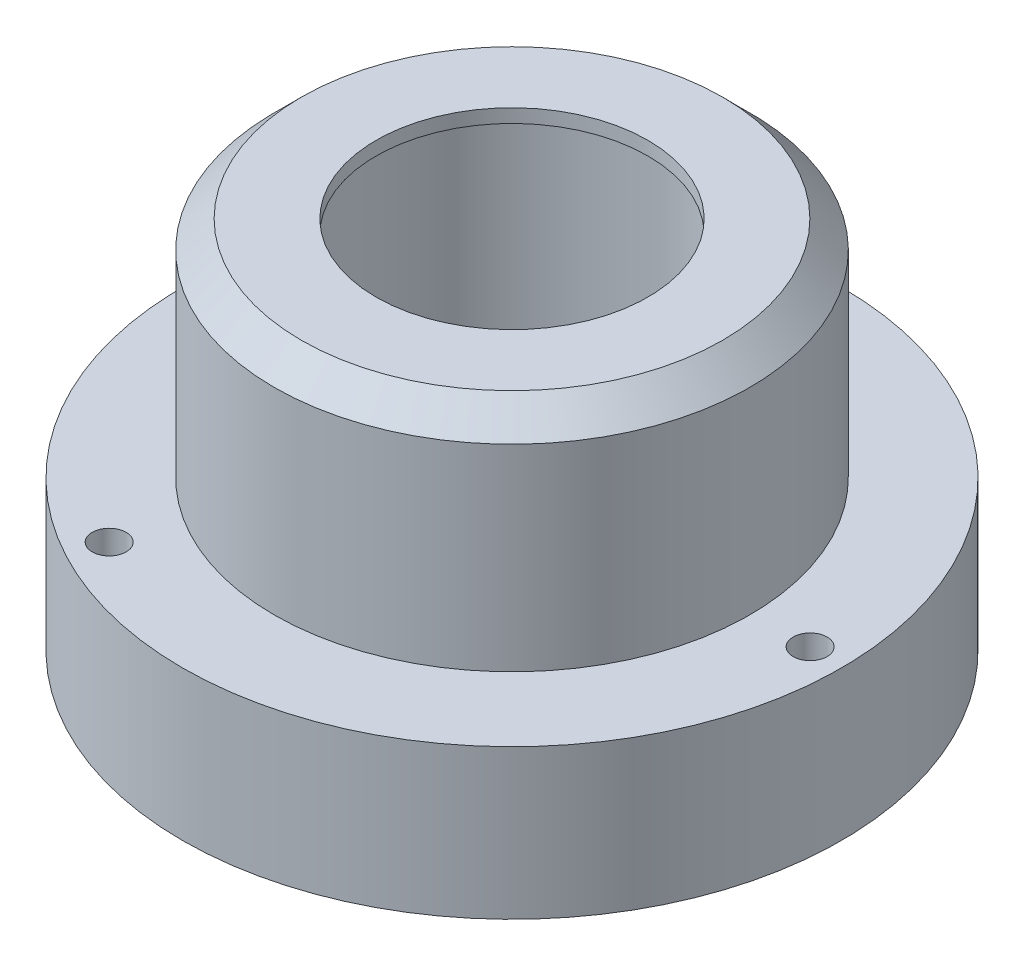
ISO-10303-21;
HEADER;
FILE_DESCRIPTION(('STEP AP214'),'2;1');
FILE_NAME('part.step','',(''),(''),'','','');
FILE_SCHEMA(('AUTOMOTIVE_DESIGN { 1 0 10303 214 1 1 1 1 }'));
ENDSEC;
DATA;
#1=APPLICATION_CONTEXT('core data for automotive mechanical design processes');
#2=APPLICATION_PROTOCOL_DEFINITION('international standard','automotive_design',2000,#1);
#3=PRODUCT_CONTEXT('',#1,'mechanical');
#4=PRODUCT('Part','Part','',(#3));
#5=PRODUCT_RELATED_PRODUCT_CATEGORY('part','',(#4));
#6=PRODUCT_DEFINITION_FORMATION('','',#4);
#7=PRODUCT_DEFINITION_CONTEXT('part definition',#1,'design');
#8=PRODUCT_DEFINITION('design','',#6,#7);
#9=PRODUCT_DEFINITION_SHAPE('','',#8);
#10=(LENGTH_UNIT() NAMED_UNIT(*) SI_UNIT(.MILLI.,.METRE.));
#11=(NAMED_UNIT(*) PLANE_ANGLE_UNIT() SI_UNIT($,.RADIAN.));
#12=(NAMED_UNIT(*) SI_UNIT($,.STERADIAN.) SOLID_ANGLE_UNIT());
#13=UNCERTAINTY_MEASURE_WITH_UNIT(LENGTH_MEASURE(1.E-05),#10,'distance_accuracy_value','');
#14=(GEOMETRIC_REPRESENTATION_CONTEXT(3) GLOBAL_UNCERTAINTY_ASSIGNED_CONTEXT((#13)) GLOBAL_UNIT_ASSIGNED_CONTEXT((#10,
#11,#12)) REPRESENTATION_CONTEXT('',''));
#15=CARTESIAN_POINT('',(0.,0.,0.));
#16=DIRECTION('',(0.,0.,1.));
#17=DIRECTION('',(1.,0.,0.));
#18=AXIS2_PLACEMENT_3D('',#15,#16,#17);
#19=CARTESIAN_POINT('',(48.5,0.,0.));
#20=DIRECTION('',(0.,1.,0.));
#21=DIRECTION('',(0.,0.,1.));
#22=AXIS2_PLACEMENT_3D('',#19,#20,#21);
#23=PLANE('',#22);
#24=CARTESIAN_POINT('',(21.4999999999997,0.,37.2390923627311));
#25=DIRECTION('',(0.,-1.,0.));
#26=DIRECTION('',(0.,0.,-1.));
#27=AXIS2_PLACEMENT_3D('',#24,#25,#26);
#28=CIRCLE('',#27,2.5);
#29=CARTESIAN_POINT('',(21.4999999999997,0.,34.7390923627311));
#30=VERTEX_POINT('',#29);
#31=EDGE_CURVE('E79',#30,#30,#28,.T.);
#32=ORIENTED_EDGE('',*,*,#31,.F.);
#33=EDGE_LOOP('',(#32));
#34=FACE_BOUND('',#33,.T.);
#35=CARTESIAN_POINT('',(21.5000000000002,0.,-37.2390923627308));
#36=DIRECTION('',(0.,-1.,0.));
#37=DIRECTION('',(0.,0.,-1.));
#38=AXIS2_PLACEMENT_3D('',#35,#36,#37);
#39=CIRCLE('',#38,2.5);
#40=CARTESIAN_POINT('',(21.5000000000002,0.,-39.7390923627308));
#41=VERTEX_POINT('',#40);
#42=EDGE_CURVE('E87',#41,#41,#39,.T.);
#43=ORIENTED_EDGE('',*,*,#42,.F.);
#44=EDGE_LOOP('',(#43));
#45=FACE_BOUND('',#44,.T.);
#46=CARTESIAN_POINT('',(-13.9999999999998,0.,-24.2487113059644));
#47=DIRECTION('',(0.,-1.,0.));
#48=DIRECTION('',(0.,0.,-1.));
#49=AXIS2_PLACEMENT_3D('',#46,#47,#48);
#50=CIRCLE('',#49,1.65);
#51=CARTESIAN_POINT('',(-13.9999999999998,0.,-25.8987113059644));
#52=VERTEX_POINT('',#51);
#53=EDGE_CURVE('E93',#52,#52,#50,.T.);
#54=ORIENTED_EDGE('',*,*,#53,.F.);
#55=EDGE_LOOP('',(#54));
#56=FACE_BOUND('',#55,.T.);
#57=CARTESIAN_POINT('',(-14.0000000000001,0.,24.2487113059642));
#58=DIRECTION('',(0.,-1.,0.));
#59=DIRECTION('',(0.,0.,-1.));
#60=AXIS2_PLACEMENT_3D('',#57,#58,#59);
#61=CIRCLE('',#60,1.65);
#62=CARTESIAN_POINT('',(-14.0000000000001,0.,22.5987113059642));
#63=VERTEX_POINT('',#62);
#64=EDGE_CURVE('E99',#63,#63,#61,.T.);
#65=ORIENTED_EDGE('',*,*,#64,.F.);
#66=EDGE_LOOP('',(#65));
#67=FACE_BOUND('',#66,.T.);
#68=CARTESIAN_POINT('',(-43.,0.,0.));
#69=DIRECTION('',(0.,-1.,0.));
#70=DIRECTION('',(0.,0.,-1.));
#71=AXIS2_PLACEMENT_3D('',#68,#69,#70);
#72=CIRCLE('',#71,2.5);
#73=CARTESIAN_POINT('',(-43.,0.,-2.5));
#74=VERTEX_POINT('',#73);
#75=EDGE_CURVE('E117',#74,#74,#72,.T.);
#76=ORIENTED_EDGE('',*,*,#75,.F.);
#77=EDGE_LOOP('',(#76));
#78=FACE_BOUND('',#77,.T.);
#79=CARTESIAN_POINT('',(28.,0.,0.));
#80=DIRECTION('',(0.,-1.,0.));
#81=DIRECTION('',(0.,0.,-1.));
#82=AXIS2_PLACEMENT_3D('',#79,#80,#81);
#83=CIRCLE('',#82,1.65);
#84=CARTESIAN_POINT('',(28.,0.,-1.65));
#85=VERTEX_POINT('',#84);
#86=EDGE_CURVE('E123',#85,#85,#83,.T.);
#87=ORIENTED_EDGE('',*,*,#86,.F.);
#88=EDGE_LOOP('',(#87));
#89=FACE_BOUND('',#88,.T.);
#90=CARTESIAN_POINT('',(0.,0.,0.));
#91=DIRECTION('',(0.,1.,0.));
#92=DIRECTION('',(0.,0.,1.));
#93=AXIS2_PLACEMENT_3D('',#90,#91,#92);
#94=CIRCLE('',#93,48.5);
#95=CARTESIAN_POINT('',(0.,0.,48.5));
#96=VERTEX_POINT('',#95);
#97=EDGE_CURVE('E132',#96,#96,#94,.T.);
#98=ORIENTED_EDGE('',*,*,#97,.F.);
#99=EDGE_LOOP('',(#98));
#100=FACE_BOUND('',#99,.T.);
#101=CARTESIAN_POINT('',(0.,0.,0.));
#102=DIRECTION('',(0.,1.,0.));
#103=DIRECTION('',(0.,0.,1.));
#104=AXIS2_PLACEMENT_3D('',#101,#102,#103);
#105=CIRCLE('',#104,23.5);
#106=CARTESIAN_POINT('',(0.,0.,23.5));
#107=VERTEX_POINT('',#106);
#108=EDGE_CURVE('E11',#107,#107,#105,.T.);
#109=ORIENTED_EDGE('',*,*,#108,.T.);
#110=EDGE_LOOP('',(#109));
#111=FACE_BOUND('',#110,.T.);
#112=ADVANCED_FACE('F35',(#34,#45,#56,#67,#78,#89,#100,#111),#23,.F.);
#113=CARTESIAN_POINT('',(0.,45.2474448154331,0.));
#114=DIRECTION('',(0.,1.,0.));
#115=DIRECTION('',(0.,0.,1.));
#116=AXIS2_PLACEMENT_3D('',#113,#114,#115);
#117=CYLINDRICAL_SURFACE('',#116,23.5);
#118=ORIENTED_EDGE('',*,*,#108,.F.);
#119=EDGE_LOOP('',(#118));
#120=FACE_BOUND('',#119,.T.);
#121=CARTESIAN_POINT('',(0.,53.,0.));
#122=DIRECTION('',(0.,1.,0.));
#123=DIRECTION('',(0.,0.,1.));
#124=AXIS2_PLACEMENT_3D('',#121,#122,#123);
#125=CIRCLE('',#124,23.5);
#126=CARTESIAN_POINT('',(0.,53.,23.5));
#127=VERTEX_POINT('',#126);
#128=EDGE_CURVE('E42',#127,#127,#125,.T.);
#129=ORIENTED_EDGE('',*,*,#128,.T.);
#130=EDGE_LOOP('',(#129));
#131=FACE_BOUND('',#130,.T.);
#132=ADVANCED_FACE('F155',(#120,#131),#117,.F.);
#133=CARTESIAN_POINT('',(23.5,53.,0.));
#134=DIRECTION('',(0.,1.,0.));
#135=DIRECTION('',(0.,0.,1.));
#136=AXIS2_PLACEMENT_3D('',#133,#134,#135);
#137=PLANE('',#136);
#138=ORIENTED_EDGE('',*,*,#128,.F.);
#139=EDGE_LOOP('',(#138));
#140=FACE_BOUND('',#139,.T.);
#141=CARTESIAN_POINT('',(0.,53.,0.));
#142=DIRECTION('',(0.,1.,0.));
#143=DIRECTION('',(0.,0.,1.));
#144=AXIS2_PLACEMENT_3D('',#141,#142,#143);
#145=CIRCLE('',#144,20.);
#146=CARTESIAN_POINT('',(0.,53.,20.));
#147=VERTEX_POINT('',#146);
#148=EDGE_CURVE('E150',#147,#147,#145,.T.);
#149=ORIENTED_EDGE('',*,*,#148,.T.);
#150=EDGE_LOOP('',(#149));
#151=FACE_BOUND('',#150,.T.);
#152=ADVANCED_FACE('F157',(#140,#151),#137,.F.);
#153=CARTESIAN_POINT('',(0.,45.2474448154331,0.));
#154=DIRECTION('',(0.,1.,0.));
#155=DIRECTION('',(0.,0.,1.));
#156=AXIS2_PLACEMENT_3D('',#153,#154,#155);
#157=CYLINDRICAL_SURFACE('',#156,20.);
#158=ORIENTED_EDGE('',*,*,#148,.F.);
#159=EDGE_LOOP('',(#158));
#160=FACE_BOUND('',#159,.T.);
#161=CARTESIAN_POINT('',(0.,55.,0.));
#162=DIRECTION('',(0.,1.,0.));
#163=DIRECTION('',(0.,0.,1.));
#164=AXIS2_PLACEMENT_3D('',#161,#162,#163);
#165=CIRCLE('',#164,20.);
#166=CARTESIAN_POINT('',(0.,55.,20.));
#167=VERTEX_POINT('',#166);
#168=EDGE_CURVE('E147',#167,#167,#165,.T.);
#169=ORIENTED_EDGE('',*,*,#168,.T.);
#170=EDGE_LOOP('',(#169));
#171=FACE_BOUND('',#170,.T.);
#172=ADVANCED_FACE('F160',(#160,#171),#157,.F.);
#173=CARTESIAN_POINT('',(20.,55.,0.));
#174=DIRECTION('',(0.,-1.,0.));
#175=DIRECTION('',(0.,0.,-1.));
#176=AXIS2_PLACEMENT_3D('',#173,#174,#175);
#177=PLANE('',#176);
#178=ORIENTED_EDGE('',*,*,#168,.F.);
#179=EDGE_LOOP('',(#178));
#180=FACE_BOUND('',#179,.T.);
#181=CARTESIAN_POINT('',(0.,55.,0.));
#182=DIRECTION('',(0.,1.,0.));
#183=DIRECTION('',(0.,0.,1.));
#184=AXIS2_PLACEMENT_3D('',#181,#182,#183);
#185=CIRCLE('',#184,31.);
#186=CARTESIAN_POINT('',(0.,55.,31.));
#187=VERTEX_POINT('',#186);
#188=EDGE_CURVE('E144',#187,#187,#185,.T.);
#189=ORIENTED_EDGE('',*,*,#188,.T.);
#190=EDGE_LOOP('',(#189));
#191=FACE_BOUND('',#190,.T.);
#192=ADVANCED_FACE('F166',(#180,#191),#177,.F.);
#193=CARTESIAN_POINT('',(0.,51.,0.));
#194=DIRECTION('',(0.,-1.,0.));
#195=DIRECTION('',(0.,0.,-1.));
#196=AXIS2_PLACEMENT_3D('',#193,#194,#195);
#197=CONICAL_SURFACE('',#196,35.,0.785398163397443);
#198=ORIENTED_EDGE('',*,*,#188,.F.);
#199=EDGE_LOOP('',(#198));
#200=FACE_BOUND('',#199,.T.);
#201=CARTESIAN_POINT('',(0.,51.,0.));
#202=DIRECTION('',(0.,1.,0.));
#203=DIRECTION('',(0.,0.,1.));
#204=AXIS2_PLACEMENT_3D('',#201,#202,#203);
#205=CIRCLE('',#204,35.);
#206=CARTESIAN_POINT('',(0.,51.,35.));
#207=VERTEX_POINT('',#206);
#208=EDGE_CURVE('E141',#207,#207,#205,.T.);
#209=ORIENTED_EDGE('',*,*,#208,.T.);
#210=EDGE_LOOP('',(#209));
#211=FACE_BOUND('',#210,.T.);
#212=ADVANCED_FACE('F172',(#200,#211),#197,.T.);
#213=CARTESIAN_POINT('',(0.,45.2474448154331,0.));
#214=DIRECTION('',(0.,1.,0.));
#215=DIRECTION('',(0.,0.,1.));
#216=AXIS2_PLACEMENT_3D('',#213,#214,#215);
#217=CYLINDRICAL_SURFACE('',#216,35.);
#218=ORIENTED_EDGE('',*,*,#208,.F.);
#219=EDGE_LOOP('',(#218));
#220=FACE_BOUND('',#219,.T.);
#221=CARTESIAN_POINT('',(0.,22.,0.));
#222=DIRECTION('',(0.,1.,0.));
#223=DIRECTION('',(0.,0.,1.));
#224=AXIS2_PLACEMENT_3D('',#221,#222,#223);
#225=CIRCLE('',#224,35.);
#226=CARTESIAN_POINT('',(0.,22.,35.));
#227=VERTEX_POINT('',#226);
#228=EDGE_CURVE('E138',#227,#227,#225,.T.);
#229=ORIENTED_EDGE('',*,*,#228,.T.);
#230=EDGE_LOOP('',(#229));
#231=FACE_BOUND('',#230,.T.);
#232=ADVANCED_FACE('F178',(#220,#231),#217,.T.);
#233=CARTESIAN_POINT('',(35.,22.,0.));
#234=DIRECTION('',(0.,-1.,0.));
#235=DIRECTION('',(0.,0.,-1.));
#236=AXIS2_PLACEMENT_3D('',#233,#234,#235);
#237=PLANE('',#236);
#238=CARTESIAN_POINT('',(-22.0764460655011,22.,-37.4817359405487));
#239=DIRECTION('',(0.,1.,0.));
#240=DIRECTION('',(0.,0.,1.));
#241=AXIS2_PLACEMENT_3D('',#238,#239,#240);
#242=CIRCLE('',#241,2.5);
#243=CARTESIAN_POINT('',(-22.0764460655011,22.,-34.9817359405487));
#244=VERTEX_POINT('',#243);
#245=EDGE_CURVE('E105',#244,#244,#242,.T.);
#246=ORIENTED_EDGE('',*,*,#245,.F.);
#247=EDGE_LOOP('',(#246));
#248=FACE_BOUND('',#247,.T.);
#249=CARTESIAN_POINT('',(-21.4219124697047,22.,37.8596310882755));
#250=DIRECTION('',(0.,1.,0.));
#251=DIRECTION('',(0.,0.,1.));
#252=AXIS2_PLACEMENT_3D('',#249,#250,#251);
#253=CIRCLE('',#252,2.5);
#254=CARTESIAN_POINT('',(-21.4219124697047,22.,40.3596310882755));
#255=VERTEX_POINT('',#254);
#256=EDGE_CURVE('E111',#255,#255,#253,.T.);
#257=ORIENTED_EDGE('',*,*,#256,.F.);
#258=EDGE_LOOP('',(#257));
#259=FACE_BOUND('',#258,.T.);
#260=CARTESIAN_POINT('',(43.498358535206,22.,-0.37789514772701));
#261=DIRECTION('',(0.,1.,0.));
#262=DIRECTION('',(0.,0.,1.));
#263=AXIS2_PLACEMENT_3D('',#260,#261,#262);
#264=CIRCLE('',#263,2.5);
#265=CARTESIAN_POINT('',(43.498358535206,22.,2.12210485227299));
#266=VERTEX_POINT('',#265);
#267=EDGE_CURVE('E129',#266,#266,#264,.T.);
#268=ORIENTED_EDGE('',*,*,#267,.F.);
#269=EDGE_LOOP('',(#268));
#270=FACE_BOUND('',#269,.T.);
#271=ORIENTED_EDGE('',*,*,#228,.F.);
#272=EDGE_LOOP('',(#271));
#273=FACE_BOUND('',#272,.T.);
#274=CARTESIAN_POINT('',(0.,22.,0.));
#275=DIRECTION('',(0.,1.,0.));
#276=DIRECTION('',(0.,0.,1.));
#277=AXIS2_PLACEMENT_3D('',#274,#275,#276);
#278=CIRCLE('',#277,48.5);
#279=CARTESIAN_POINT('',(0.,22.,48.5));
#280=VERTEX_POINT('',#279);
#281=EDGE_CURVE('E135',#280,#280,#278,.T.);
#282=ORIENTED_EDGE('',*,*,#281,.T.);
#283=EDGE_LOOP('',(#282));
#284=FACE_BOUND('',#283,.T.);
#285=ADVANCED_FACE('F184',(#248,#259,#270,#273,#284),#237,.F.);
#286=CARTESIAN_POINT('',(0.,45.2474448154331,0.));
#287=DIRECTION('',(0.,1.,0.));
#288=DIRECTION('',(0.,0.,1.));
#289=AXIS2_PLACEMENT_3D('',#286,#287,#288);
#290=CYLINDRICAL_SURFACE('',#289,48.5);
#291=ORIENTED_EDGE('',*,*,#281,.F.);
#292=EDGE_LOOP('',(#291));
#293=FACE_BOUND('',#292,.T.);
#294=ORIENTED_EDGE('',*,*,#97,.T.);
#295=EDGE_LOOP('',(#294));
#296=FACE_BOUND('',#295,.T.);
#297=ADVANCED_FACE('F190',(#293,#296),#290,.T.);
#298=CARTESIAN_POINT('',(43.498358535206,22.,-0.37789514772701));
#299=DIRECTION('',(0.,1.,0.));
#300=DIRECTION('',(0.,0.,1.));
#301=AXIS2_PLACEMENT_3D('',#298,#299,#300);
#302=CYLINDRICAL_SURFACE('',#301,2.5);
#303=CARTESIAN_POINT('',(43.498358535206,5.,-0.37789514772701));
#304=DIRECTION('',(0.,1.,0.));
#305=DIRECTION('',(0.,0.,1.));
#306=AXIS2_PLACEMENT_3D('',#303,#304,#305);
#307=CIRCLE('',#306,2.5);
#308=CARTESIAN_POINT('',(43.498358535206,5.,2.12210485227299));
#309=VERTEX_POINT('',#308);
#310=EDGE_CURVE('E126',#309,#309,#307,.T.);
#311=ORIENTED_EDGE('',*,*,#310,.F.);
#312=EDGE_LOOP('',(#311));
#313=FACE_BOUND('',#312,.T.);
#314=ORIENTED_EDGE('',*,*,#267,.T.);
#315=EDGE_LOOP('',(#314));
#316=FACE_BOUND('',#315,.T.);
#317=ADVANCED_FACE('F197',(#313,#316),#302,.F.);
#318=CARTESIAN_POINT('',(43.498358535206,5.,-0.37789514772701));
#319=DIRECTION('',(0.,1.,0.));
#320=DIRECTION('',(0.,0.,1.));
#321=AXIS2_PLACEMENT_3D('',#318,#319,#320);
#322=CONICAL_SURFACE('',#321,2.5,1.04719755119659);
#323=CARTESIAN_POINT('',(43.498358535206,3.55662432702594,-0.37789514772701));
#324=VERTEX_POINT('',#323);
#325=VERTEX_LOOP('',#324);
#326=FACE_BOUND('',#325,.T.);
#327=ORIENTED_EDGE('',*,*,#310,.T.);
#328=EDGE_LOOP('',(#327));
#329=FACE_BOUND('',#328,.T.);
#330=ADVANCED_FACE('F212',(#326,#329),#322,.F.);
#331=CARTESIAN_POINT('',(28.,0.,0.));
#332=DIRECTION('',(0.,-1.,0.));
#333=DIRECTION('',(0.,0.,-1.));
#334=AXIS2_PLACEMENT_3D('',#331,#332,#333);
#335=CYLINDRICAL_SURFACE('',#334,1.65);
#336=CARTESIAN_POINT('',(28.,11.5,0.));
#337=DIRECTION('',(0.,-1.,0.));
#338=DIRECTION('',(0.,0.,-1.));
#339=AXIS2_PLACEMENT_3D('',#336,#337,#338);
#340=CIRCLE('',#339,1.65);
#341=CARTESIAN_POINT('',(28.,11.5,-1.64999999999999));
#342=VERTEX_POINT('',#341);
#343=EDGE_CURVE('E120',#342,#342,#340,.T.);
#344=ORIENTED_EDGE('',*,*,#343,.F.);
#345=EDGE_LOOP('',(#344));
#346=FACE_BOUND('',#345,.T.);
#347=ORIENTED_EDGE('',*,*,#86,.T.);
#348=EDGE_LOOP('',(#347));
#349=FACE_BOUND('',#348,.T.);
#350=ADVANCED_FACE('F216',(#346,#349),#335,.F.);
#351=CARTESIAN_POINT('',(28.,11.5,0.));
#352=DIRECTION('',(0.,-1.,0.));
#353=DIRECTION('',(0.,0.,-1.));
#354=AXIS2_PLACEMENT_3D('',#351,#352,#353);
#355=CONICAL_SURFACE('',#354,1.65,1.04719755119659);
#356=CARTESIAN_POINT('',(28.,12.4526279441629,0.));
#357=VERTEX_POINT('',#356);
#358=VERTEX_LOOP('',#357);
#359=FACE_BOUND('',#358,.T.);
#360=ORIENTED_EDGE('',*,*,#343,.T.);
#361=EDGE_LOOP('',(#360));
#362=FACE_BOUND('',#361,.T.);
#363=ADVANCED_FACE('F219',(#359,#362),#355,.F.);
#364=CARTESIAN_POINT('',(-43.,0.,0.));
#365=DIRECTION('',(0.,-1.,0.));
#366=DIRECTION('',(0.,0.,-1.));
#367=AXIS2_PLACEMENT_3D('',#364,#365,#366);
#368=CYLINDRICAL_SURFACE('',#367,2.5);
#369=CARTESIAN_POINT('',(-43.,17.,0.));
#370=DIRECTION('',(0.,-1.,0.));
#371=DIRECTION('',(0.,0.,-1.));
#372=AXIS2_PLACEMENT_3D('',#369,#370,#371);
#373=CIRCLE('',#372,2.5);
#374=CARTESIAN_POINT('',(-43.,17.,-2.49999999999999));
#375=VERTEX_POINT('',#374);
#376=EDGE_CURVE('E114',#375,#375,#373,.T.);
#377=ORIENTED_EDGE('',*,*,#376,.F.);
#378=EDGE_LOOP('',(#377));
#379=FACE_BOUND('',#378,.T.);
#380=ORIENTED_EDGE('',*,*,#75,.T.);
#381=EDGE_LOOP('',(#380));
#382=FACE_BOUND('',#381,.T.);
#383=ADVANCED_FACE('F223',(#379,#382),#368,.F.);
#384=CARTESIAN_POINT('',(-43.,17.,0.));
#385=DIRECTION('',(0.,-1.,0.));
#386=DIRECTION('',(0.,0.,-1.));
#387=AXIS2_PLACEMENT_3D('',#384,#385,#386);
#388=CONICAL_SURFACE('',#387,2.5,1.0471975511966);
#389=CARTESIAN_POINT('',(-43.,18.4433756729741,0.));
#390=VERTEX_POINT('',#389);
#391=VERTEX_LOOP('',#390);
#392=FACE_BOUND('',#391,.T.);
#393=ORIENTED_EDGE('',*,*,#376,.T.);
#394=EDGE_LOOP('',(#393));
#395=FACE_BOUND('',#394,.T.);
#396=ADVANCED_FACE('F226',(#392,#395),#388,.F.);
#397=CARTESIAN_POINT('',(-21.4219124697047,22.,37.8596310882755));
#398=DIRECTION('',(0.,1.,0.));
#399=DIRECTION('',(0.,0.,1.));
#400=AXIS2_PLACEMENT_3D('',#397,#398,#399);
#401=CYLINDRICAL_SURFACE('',#400,2.5);
#402=CARTESIAN_POINT('',(-21.4219124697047,5.,37.8596310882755));
#403=DIRECTION('',(0.,1.,0.));
#404=DIRECTION('',(0.,0.,1.));
#405=AXIS2_PLACEMENT_3D('',#402,#403,#404);
#406=CIRCLE('',#405,2.5);
#407=CARTESIAN_POINT('',(-21.4219124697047,5.,40.3596310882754));
#408=VERTEX_POINT('',#407);
#409=EDGE_CURVE('E108',#408,#408,#406,.T.);
#410=ORIENTED_EDGE('',*,*,#409,.F.);
#411=EDGE_LOOP('',(#410));
#412=FACE_BOUND('',#411,.T.);
#413=ORIENTED_EDGE('',*,*,#256,.T.);
#414=EDGE_LOOP('',(#413));
#415=FACE_BOUND('',#414,.T.);
#416=ADVANCED_FACE('F230',(#412,#415),#401,.F.);
#417=CARTESIAN_POINT('',(-21.4219124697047,5.,37.8596310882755));
#418=DIRECTION('',(0.,1.,0.));
#419=DIRECTION('',(0.,0.,1.));
#420=AXIS2_PLACEMENT_3D('',#417,#418,#419);
#421=CONICAL_SURFACE('',#420,2.5,1.04719755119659);
#422=CARTESIAN_POINT('',(-21.4219124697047,3.55662432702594,37.8596310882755));
#423=VERTEX_POINT('',#422);
#424=VERTEX_LOOP('',#423);
#425=FACE_BOUND('',#424,.T.);
#426=ORIENTED_EDGE('',*,*,#409,.T.);
#427=EDGE_LOOP('',(#426));
#428=FACE_BOUND('',#427,.T.);
#429=ADVANCED_FACE('F234',(#425,#428),#421,.F.);
#430=CARTESIAN_POINT('',(-22.0764460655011,22.,-37.4817359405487));
#431=DIRECTION('',(0.,1.,0.));
#432=DIRECTION('',(0.,0.,1.));
#433=AXIS2_PLACEMENT_3D('',#430,#431,#432);
#434=CYLINDRICAL_SURFACE('',#433,2.5);
#435=CARTESIAN_POINT('',(-22.0764460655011,5.,-37.4817359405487));
#436=DIRECTION('',(0.,1.,0.));
#437=DIRECTION('',(0.,0.,1.));
#438=AXIS2_PLACEMENT_3D('',#435,#436,#437);
#439=CIRCLE('',#438,2.5);
#440=CARTESIAN_POINT('',(-22.0764460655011,5.,-34.9817359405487));
#441=VERTEX_POINT('',#440);
#442=EDGE_CURVE('E102',#441,#441,#439,.T.);
#443=ORIENTED_EDGE('',*,*,#442,.F.);
#444=EDGE_LOOP('',(#443));
#445=FACE_BOUND('',#444,.T.);
#446=ORIENTED_EDGE('',*,*,#245,.T.);
#447=EDGE_LOOP('',(#446));
#448=FACE_BOUND('',#447,.T.);
#449=ADVANCED_FACE('F238',(#445,#448),#434,.F.);
#450=CARTESIAN_POINT('',(-22.0764460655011,5.,-37.4817359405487));
#451=DIRECTION('',(0.,1.,0.));
#452=DIRECTION('',(0.,0.,1.));
#453=AXIS2_PLACEMENT_3D('',#450,#451,#452);
#454=CONICAL_SURFACE('',#453,2.5,1.04719755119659);
#455=CARTESIAN_POINT('',(-22.0764460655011,3.55662432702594,-37.4817359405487));
#456=VERTEX_POINT('',#455);
#457=VERTEX_LOOP('',#456);
#458=FACE_BOUND('',#457,.T.);
#459=ORIENTED_EDGE('',*,*,#442,.T.);
#460=EDGE_LOOP('',(#459));
#461=FACE_BOUND('',#460,.T.);
#462=ADVANCED_FACE('F242',(#458,#461),#454,.F.);
#463=CARTESIAN_POINT('',(-14.0000000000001,0.,24.2487113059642));
#464=DIRECTION('',(0.,-1.,0.));
#465=DIRECTION('',(0.,0.,-1.));
#466=AXIS2_PLACEMENT_3D('',#463,#464,#465);
#467=CYLINDRICAL_SURFACE('',#466,1.65);
#468=CARTESIAN_POINT('',(-14.0000000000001,11.5,24.2487113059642));
#469=DIRECTION('',(0.,-1.,0.));
#470=DIRECTION('',(0.,0.,-1.));
#471=AXIS2_PLACEMENT_3D('',#468,#469,#470);
#472=CIRCLE('',#471,1.65);
#473=CARTESIAN_POINT('',(-14.0000000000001,11.5,22.5987113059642));
#474=VERTEX_POINT('',#473);
#475=EDGE_CURVE('E96',#474,#474,#472,.T.);
#476=ORIENTED_EDGE('',*,*,#475,.F.);
#477=EDGE_LOOP('',(#476));
#478=FACE_BOUND('',#477,.T.);
#479=ORIENTED_EDGE('',*,*,#64,.T.);
#480=EDGE_LOOP('',(#479));
#481=FACE_BOUND('',#480,.T.);
#482=ADVANCED_FACE('F246',(#478,#481),#467,.F.);
#483=CARTESIAN_POINT('',(-14.0000000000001,11.5,24.2487113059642));
#484=DIRECTION('',(0.,-1.,0.));
#485=DIRECTION('',(0.,0.,-1.));
#486=AXIS2_PLACEMENT_3D('',#483,#484,#485);
#487=CONICAL_SURFACE('',#486,1.65,1.0471975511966);
#488=CARTESIAN_POINT('',(-14.0000000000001,12.4526279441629,24.2487113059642));
#489=VERTEX_POINT('',#488);
#490=VERTEX_LOOP('',#489);
#491=FACE_BOUND('',#490,.T.);
#492=ORIENTED_EDGE('',*,*,#475,.T.);
#493=EDGE_LOOP('',(#492));
#494=FACE_BOUND('',#493,.T.);
#495=ADVANCED_FACE('F250',(#491,#494),#487,.F.);
#496=CARTESIAN_POINT('',(-13.9999999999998,0.,-24.2487113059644));
#497=DIRECTION('',(0.,-1.,0.));
#498=DIRECTION('',(0.,0.,-1.));
#499=AXIS2_PLACEMENT_3D('',#496,#497,#498);
#500=CYLINDRICAL_SURFACE('',#499,1.65);
#501=CARTESIAN_POINT('',(-13.9999999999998,11.5,-24.2487113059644));
#502=DIRECTION('',(0.,-1.,0.));
#503=DIRECTION('',(0.,0.,-1.));
#504=AXIS2_PLACEMENT_3D('',#501,#502,#503);
#505=CIRCLE('',#504,1.65);
#506=CARTESIAN_POINT('',(-13.9999999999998,11.5,-25.8987113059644));
#507=VERTEX_POINT('',#506);
#508=EDGE_CURVE('E90',#507,#507,#505,.T.);
#509=ORIENTED_EDGE('',*,*,#508,.F.);
#510=EDGE_LOOP('',(#509));
#511=FACE_BOUND('',#510,.T.);
#512=ORIENTED_EDGE('',*,*,#53,.T.);
#513=EDGE_LOOP('',(#512));
#514=FACE_BOUND('',#513,.T.);
#515=ADVANCED_FACE('F254',(#511,#514),#500,.F.);
#516=CARTESIAN_POINT('',(-13.9999999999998,11.5,-24.2487113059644));
#517=DIRECTION('',(0.,-1.,0.));
#518=DIRECTION('',(0.,0.,-1.));
#519=AXIS2_PLACEMENT_3D('',#516,#517,#518);
#520=CONICAL_SURFACE('',#519,1.65,1.0471975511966);
#521=CARTESIAN_POINT('',(-13.9999999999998,12.4526279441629,-24.2487113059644));
#522=VERTEX_POINT('',#521);
#523=VERTEX_LOOP('',#522);
#524=FACE_BOUND('',#523,.T.);
#525=ORIENTED_EDGE('',*,*,#508,.T.);
#526=EDGE_LOOP('',(#525));
#527=FACE_BOUND('',#526,.T.);
#528=ADVANCED_FACE('F258',(#524,#527),#520,.F.);
#529=CARTESIAN_POINT('',(21.5000000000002,0.,-37.2390923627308));
#530=DIRECTION('',(0.,-1.,0.));
#531=DIRECTION('',(0.,0.,-1.));
#532=AXIS2_PLACEMENT_3D('',#529,#530,#531);
#533=CYLINDRICAL_SURFACE('',#532,2.5);
#534=CARTESIAN_POINT('',(21.5000000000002,17.,-37.2390923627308));
#535=DIRECTION('',(0.,-1.,0.));
#536=DIRECTION('',(0.,0.,-1.));
#537=AXIS2_PLACEMENT_3D('',#534,#535,#536);
#538=CIRCLE('',#537,2.5);
#539=CARTESIAN_POINT('',(21.5000000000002,17.,-39.7390923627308));
#540=VERTEX_POINT('',#539);
#541=EDGE_CURVE('E82',#540,#540,#538,.T.);
#542=ORIENTED_EDGE('',*,*,#541,.F.);
#543=EDGE_LOOP('',(#542));
#544=FACE_BOUND('',#543,.T.);
#545=ORIENTED_EDGE('',*,*,#42,.T.);
#546=EDGE_LOOP('',(#545));
#547=FACE_BOUND('',#546,.T.);
#548=ADVANCED_FACE('F262',(#544,#547),#533,.F.);
#549=CARTESIAN_POINT('',(21.5000000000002,17.,-37.2390923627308));
#550=DIRECTION('',(0.,-1.,0.));
#551=DIRECTION('',(0.,0.,-1.));
#552=AXIS2_PLACEMENT_3D('',#549,#550,#551);
#553=CONICAL_SURFACE('',#552,2.5,1.0471975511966);
#554=CARTESIAN_POINT('',(21.5000000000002,18.4433756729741,-37.2390923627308));
#555=VERTEX_POINT('',#554);
#556=VERTEX_LOOP('',#555);
#557=FACE_BOUND('',#556,.T.);
#558=ORIENTED_EDGE('',*,*,#541,.T.);
#559=EDGE_LOOP('',(#558));
#560=FACE_BOUND('',#559,.T.);
#561=ADVANCED_FACE('F266',(#557,#560),#553,.F.);
#562=CARTESIAN_POINT('',(21.4999999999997,0.,37.2390923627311));
#563=DIRECTION('',(0.,-1.,0.));
#564=DIRECTION('',(0.,0.,-1.));
#565=AXIS2_PLACEMENT_3D('',#562,#563,#564);
#566=CYLINDRICAL_SURFACE('',#565,2.5);
#567=CARTESIAN_POINT('',(21.4999999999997,17.,37.2390923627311));
#568=DIRECTION('',(0.,-1.,0.));
#569=DIRECTION('',(0.,0.,-1.));
#570=AXIS2_PLACEMENT_3D('',#567,#568,#569);
#571=CIRCLE('',#570,2.5);
#572=CARTESIAN_POINT('',(21.4999999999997,17.,34.7390923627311));
#573=VERTEX_POINT('',#572);
#574=EDGE_CURVE('E77',#573,#573,#571,.T.);
#575=ORIENTED_EDGE('',*,*,#574,.F.);
#576=EDGE_LOOP('',(#575));
#577=FACE_BOUND('',#576,.T.);
#578=ORIENTED_EDGE('',*,*,#31,.T.);
#579=EDGE_LOOP('',(#578));
#580=FACE_BOUND('',#579,.T.);
#581=ADVANCED_FACE('F73',(#577,#580),#566,.F.);
#582=CARTESIAN_POINT('',(21.4999999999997,17.,37.2390923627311));
#583=DIRECTION('',(0.,-1.,0.));
#584=DIRECTION('',(0.,0.,-1.));
#585=AXIS2_PLACEMENT_3D('',#582,#583,#584);
#586=CONICAL_SURFACE('',#585,2.5,1.0471975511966);
#587=CARTESIAN_POINT('',(21.4999999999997,18.4433756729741,37.2390923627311));
#588=VERTEX_POINT('',#587);
#589=VERTEX_LOOP('',#588);
#590=FACE_BOUND('',#589,.T.);
#591=ORIENTED_EDGE('',*,*,#574,.T.);
#592=EDGE_LOOP('',(#591));
#593=FACE_BOUND('',#592,.T.);
#594=ADVANCED_FACE('F70',(#590,#593),#586,.F.);
#595=CLOSED_SHELL('',(#112,#132,#152,#172,#192,#212,#232,#285,#297,#317,#330,#350,#363,#383,
#396,#416,#429,#449,#462,#482,#495,#515,#528,#548,#561,#581,#594));
#596=MANIFOLD_SOLID_BREP('B2',#595);
#597=ADVANCED_BREP_SHAPE_REPRESENTATION('',(#18,#596),#14);
#598=SHAPE_DEFINITION_REPRESENTATION(#9,#597);
ENDSEC;
END-ISO-10303-21;
